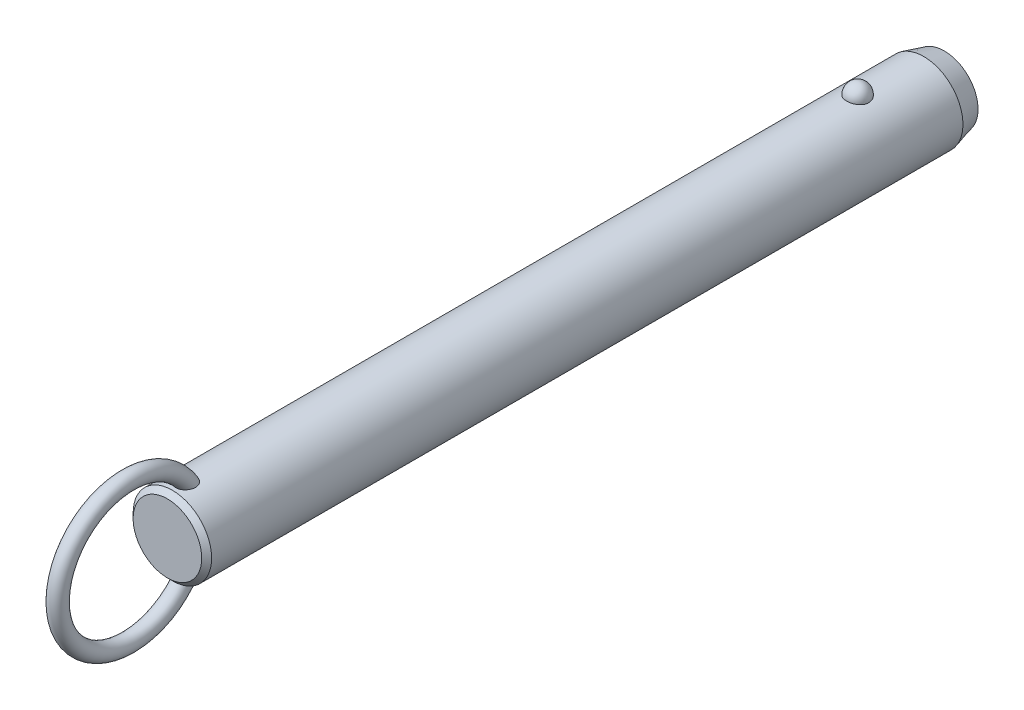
ISO-10303-21;
HEADER;
FILE_DESCRIPTION(('STEP AP214'),'2;1');
FILE_NAME('part.step','',(''),(''),'','','');
FILE_SCHEMA(('AUTOMOTIVE_DESIGN { 1 0 10303 214 1 1 1 1 }'));
ENDSEC;
DATA;
#1=APPLICATION_CONTEXT('core data for automotive mechanical design processes');
#2=APPLICATION_PROTOCOL_DEFINITION('international standard','automotive_design',2000,#1);
#3=PRODUCT_CONTEXT('',#1,'mechanical');
#4=PRODUCT('Part','Part','',(#3));
#5=PRODUCT_RELATED_PRODUCT_CATEGORY('part','',(#4));
#6=PRODUCT_DEFINITION_FORMATION('','',#4);
#7=PRODUCT_DEFINITION_CONTEXT('part definition',#1,'design');
#8=PRODUCT_DEFINITION('design','',#6,#7);
#9=PRODUCT_DEFINITION_SHAPE('','',#8);
#10=(LENGTH_UNIT() NAMED_UNIT(*) SI_UNIT(.MILLI.,.METRE.));
#11=(NAMED_UNIT(*) PLANE_ANGLE_UNIT() SI_UNIT($,.RADIAN.));
#12=(NAMED_UNIT(*) SI_UNIT($,.STERADIAN.) SOLID_ANGLE_UNIT());
#13=UNCERTAINTY_MEASURE_WITH_UNIT(LENGTH_MEASURE(1.E-05),#10,'distance_accuracy_value','');
#14=(GEOMETRIC_REPRESENTATION_CONTEXT(3) GLOBAL_UNCERTAINTY_ASSIGNED_CONTEXT((#13)) GLOBAL_UNIT_ASSIGNED_CONTEXT((#10,
#11,#12)) REPRESENTATION_CONTEXT('',''));
#15=CARTESIAN_POINT('',(0.,0.,0.));
#16=DIRECTION('',(0.,0.,1.));
#17=DIRECTION('',(1.,0.,0.));
#18=AXIS2_PLACEMENT_3D('',#15,#16,#17);
#19=CARTESIAN_POINT('',(0.,0.,154.9));
#20=DIRECTION('',(0.,0.,-1.));
#21=DIRECTION('',(-1.,0.,0.));
#22=AXIS2_PLACEMENT_3D('',#19,#20,#21);
#23=CYLINDRICAL_SURFACE('',#22,9.5);
#24=CARTESIAN_POINT('',(2.67259918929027,9.11631578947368,-2.70000000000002));
#25=CARTESIAN_POINT('',(2.6725968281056,9.11631786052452,-2.54909854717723));
#26=CARTESIAN_POINT('',(2.66030567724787,9.11994722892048,-2.39816735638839));
#27=CARTESIAN_POINT('',(2.6114347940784,9.13405924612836,-2.10058568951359));
#28=CARTESIAN_POINT('',(2.57484658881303,9.14454428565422,-1.95393672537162));
#29=CARTESIAN_POINT('',(2.47830875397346,9.17117631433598,-1.66916069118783));
#30=CARTESIAN_POINT('',(2.41836936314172,9.18732082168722,-1.53102991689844));
#31=CARTESIAN_POINT('',(2.27661331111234,9.22346780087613,-1.26705393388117));
#32=CARTESIAN_POINT('',(2.19479699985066,9.24347021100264,-1.14120852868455));
#33=CARTESIAN_POINT('',(2.01085282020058,9.28522401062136,-0.904632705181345));
#34=CARTESIAN_POINT('',(1.90862396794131,9.30698376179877,-0.793982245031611));
#35=CARTESIAN_POINT('',(1.6867437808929,9.34973971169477,-0.59160721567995));
#36=CARTESIAN_POINT('',(1.56709244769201,9.37073591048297,-0.499882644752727));
#37=CARTESIAN_POINT('',(1.31393976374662,9.40956370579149,-0.338167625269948));
#38=CARTESIAN_POINT('',(1.18048026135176,9.42740444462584,-0.268113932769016));
#39=CARTESIAN_POINT('',(0.903154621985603,9.45799906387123,-0.151390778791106));
#40=CARTESIAN_POINT('',(0.759289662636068,9.47075351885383,-0.104718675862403));
#41=CARTESIAN_POINT('',(0.468074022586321,9.48956256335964,-0.0367633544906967));
#42=CARTESIAN_POINT('',(0.320836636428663,9.49573643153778,-0.0150275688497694));
#43=CARTESIAN_POINT('',(0.0246714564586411,9.50112183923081,0.00396199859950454));
#44=CARTESIAN_POINT('',(-0.124256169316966,9.50033406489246,0.00121819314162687));
#45=CARTESIAN_POINT('',(-0.417264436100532,9.4919475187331,-0.0284441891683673));
#46=CARTESIAN_POINT('',(-0.56138413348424,9.48444885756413,-0.0550074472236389));
#47=CARTESIAN_POINT('',(-0.842986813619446,9.46357853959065,-0.131064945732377));
#48=CARTESIAN_POINT('',(-0.980469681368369,9.450206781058,-0.180559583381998));
#49=CARTESIAN_POINT('',(-1.24585005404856,9.41890822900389,-0.301476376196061));
#50=CARTESIAN_POINT('',(-1.37368611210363,9.40095498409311,-0.373026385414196));
#51=CARTESIAN_POINT('',(-1.61552738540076,9.36242964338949,-0.536025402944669));
#52=CARTESIAN_POINT('',(-1.72953116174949,9.34185727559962,-0.627476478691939));
#53=CARTESIAN_POINT('',(-1.9429225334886,9.29984568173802,-0.829844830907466));
#54=CARTESIAN_POINT('',(-2.04198021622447,9.27839736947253,-0.941108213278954));
#55=CARTESIAN_POINT('',(-2.22026460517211,9.23735994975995,-1.17883414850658));
#56=CARTESIAN_POINT('',(-2.29948985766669,9.21777097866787,-1.30529781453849));
#57=CARTESIAN_POINT('',(-2.43697287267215,9.18238994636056,-1.57158566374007));
#58=CARTESIAN_POINT('',(-2.49497068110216,9.16664569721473,-1.71155057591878));
#59=CARTESIAN_POINT('',(-2.5872073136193,9.14104303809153,-1.99961197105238));
#60=CARTESIAN_POINT('',(-2.62144683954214,9.13118445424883,-2.1477082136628));
#61=CARTESIAN_POINT('',(-2.66521466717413,9.11850622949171,-2.44715424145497));
#62=CARTESIAN_POINT('',(-2.67484831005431,9.11565658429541,-2.59848735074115));
#63=CARTESIAN_POINT('',(-2.66946735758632,9.11723375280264,-2.90067317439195));
#64=CARTESIAN_POINT('',(-2.65445345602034,9.12166036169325,-3.05152590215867));
#65=CARTESIAN_POINT('',(-2.60029711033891,9.13724422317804,-3.34766110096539));
#66=CARTESIAN_POINT('',(-2.56127978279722,9.14836656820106,-3.49296833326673));
#67=CARTESIAN_POINT('',(-2.46018844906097,9.17606676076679,-3.77477535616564));
#68=CARTESIAN_POINT('',(-2.39811349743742,9.1926448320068,-3.91127478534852));
#69=CARTESIAN_POINT('',(-2.25202303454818,9.22952198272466,-4.17244273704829));
#70=CARTESIAN_POINT('',(-2.16788714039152,9.24984129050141,-4.29704106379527));
#71=CARTESIAN_POINT('',(-1.9799408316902,9.29188255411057,-4.53013066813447));
#72=CARTESIAN_POINT('',(-1.87612963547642,9.31360456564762,-4.63862130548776));
#73=CARTESIAN_POINT('',(-1.65105429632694,9.35612959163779,-4.83690299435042));
#74=CARTESIAN_POINT('',(-1.52972405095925,9.37692871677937,-4.9266199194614));
#75=CARTESIAN_POINT('',(-1.27318250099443,9.41518970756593,-5.08429106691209));
#76=CARTESIAN_POINT('',(-1.13797219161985,9.432651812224,-5.15224684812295));
#77=CARTESIAN_POINT('',(-0.859280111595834,9.46208255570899,-5.26371827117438));
#78=CARTESIAN_POINT('',(-0.715925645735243,9.47411833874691,-5.30753421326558));
#79=CARTESIAN_POINT('',(-0.423550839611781,9.4916822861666,-5.37076321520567));
#80=CARTESIAN_POINT('',(-0.2745312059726,9.49721125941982,-5.39017930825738));
#81=CARTESIAN_POINT('',(0.0218446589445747,9.50110860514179,-5.40390587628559));
#82=CARTESIAN_POINT('',(0.16917707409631,9.49961381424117,-5.39869609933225));
#83=CARTESIAN_POINT('',(0.460808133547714,9.48993906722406,-5.36441955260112));
#84=CARTESIAN_POINT('',(0.605106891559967,9.48175936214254,-5.33535367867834));
#85=CARTESIAN_POINT('',(0.886027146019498,9.4596376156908,-5.25435587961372));
#86=CARTESIAN_POINT('',(1.02267710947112,9.44571881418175,-5.20251612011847));
#87=CARTESIAN_POINT('',(1.28523827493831,9.41358993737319,-5.07741549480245));
#88=CARTESIAN_POINT('',(1.41114877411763,9.39537958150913,-5.00415322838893));
#89=CARTESIAN_POINT('',(1.65085227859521,9.3562644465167,-4.83684599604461));
#90=CARTESIAN_POINT('',(1.76442346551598,9.33532178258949,-4.74249218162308));
#91=CARTESIAN_POINT('',(1.97425672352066,9.29321198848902,-4.53620389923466));
#92=CARTESIAN_POINT('',(2.07051582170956,9.27204482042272,-4.42426641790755));
#93=CARTESIAN_POINT('',(2.24490086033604,9.23139221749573,-4.18363183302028));
#94=CARTESIAN_POINT('',(2.32267019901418,9.21194380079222,-4.05466990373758));
#95=CARTESIAN_POINT('',(2.45584092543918,9.1773419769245,-3.78517836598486));
#96=CARTESIAN_POINT('',(2.5112497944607,9.16218713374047,-3.644652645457));
#97=CARTESIAN_POINT('',(2.59380876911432,9.13913522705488,-3.37104301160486));
#98=CARTESIAN_POINT('',(2.62330266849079,9.13064624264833,-3.23871053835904));
#99=CARTESIAN_POINT('',(2.66269870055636,9.11923566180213,-2.97092664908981));
#100=CARTESIAN_POINT('',(2.67260130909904,9.11631393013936,-2.83547530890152));
#101=CARTESIAN_POINT('',(2.67259918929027,9.11631578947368,-2.70000000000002));
#102=B_SPLINE_CURVE_WITH_KNOTS('',3,(#24,#25,#26,#27,#28,#29,#30,#31,#32,#33,#34,#35,#36,#37,
#38,#39,#40,#41,#42,#43,#44,#45,#46,#47,#48,#49,#50,#51,#52,#53,#54,#55,#56,#57,#58,#59,#60,#61,
#62,#63,#64,#65,#66,#67,#68,#69,#70,#71,#72,#73,#74,#75,#76,#77,#78,#79,#80,#81,#82,#83,#84,#85,
#86,#87,#88,#89,#90,#91,#92,#93,#94,#95,#96,#97,#98,#99,#100,#101),.UNSPECIFIED.,.T.,.F.,(4,2,2,
2,2,2,2,2,2,2,2,2,2,2,2,2,2,2,2,2,2,2,2,2,2,2,2,2,2,2,2,2,2,2,2,2,2,2,4),(0.,0.452217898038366,
0.904593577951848,1.35677112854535,1.80894144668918,2.26340676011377,2.71787203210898,
3.17099820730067,3.62407318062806,4.0687883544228,4.51345969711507,4.95160616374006,
5.38976021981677,5.83050358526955,6.27129275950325,6.72071308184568,7.17016633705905,
7.62495278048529,8.07972578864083,8.53254856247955,8.98535859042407,9.43582813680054,
9.88631615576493,10.3393155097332,10.7923328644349,11.2471065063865,11.7018475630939,
12.150795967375,12.599688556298,13.0398725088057,13.4800399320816,13.9184421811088,
14.3568730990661,14.802202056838,15.2476074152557,15.7010097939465,16.1542603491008,
16.5602594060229,16.966248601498),.UNSPECIFIED.);
#103=CARTESIAN_POINT('',(2.67259918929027,9.11631578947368,-2.70000000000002));
#104=VERTEX_POINT('',#103);
#105=EDGE_CURVE('E41',#104,#104,#102,.T.);
#106=ORIENTED_EDGE('',*,*,#105,.T.);
#107=EDGE_LOOP('',(#106));
#108=FACE_BOUND('',#107,.T.);
#109=CARTESIAN_POINT('',(0.,0.,163.22));
#110=DIRECTION('',(0.,0.,1.));
#111=DIRECTION('',(1.,0.,0.));
#112=AXIS2_PLACEMENT_3D('',#109,#110,#111);
#113=CIRCLE('',#112,9.5);
#114=CARTESIAN_POINT('',(9.5,0.,163.22));
#115=VERTEX_POINT('',#114);
#116=EDGE_CURVE('E10',#115,#115,#113,.F.);
#117=ORIENTED_EDGE('',*,*,#116,.T.);
#118=EDGE_LOOP('',(#117));
#119=FACE_BOUND('',#118,.T.);
#120=CARTESIAN_POINT('',(-0.697062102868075,-9.47439269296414,157.567808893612));
#121=CARTESIAN_POINT('',(-0.799579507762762,-9.46685146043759,157.607482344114));
#122=CARTESIAN_POINT('',(-0.89857563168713,-9.45788043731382,157.6559309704));
#123=CARTESIAN_POINT('',(-1.08670047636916,-9.43811593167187,157.768868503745));
#124=CARTESIAN_POINT('',(-1.17583204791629,-9.42732297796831,157.833352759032));
#125=CARTESIAN_POINT('',(-1.34179806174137,-9.40513672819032,157.976209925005));
#126=CARTESIAN_POINT('',(-1.41865133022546,-9.39374438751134,158.054561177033));
#127=CARTESIAN_POINT('',(-1.5586004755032,-9.37154196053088,158.222752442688));
#128=CARTESIAN_POINT('',(-1.62169476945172,-9.3607319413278,158.31259377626));
#129=CARTESIAN_POINT('',(-1.73527695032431,-9.34035749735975,158.504500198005));
#130=CARTESIAN_POINT('',(-1.78522266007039,-9.33085270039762,158.606891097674));
#131=CARTESIAN_POINT('',(-1.86924997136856,-9.3143834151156,158.818148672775));
#132=CARTESIAN_POINT('',(-1.90332570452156,-9.30741986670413,158.927017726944));
#133=CARTESIAN_POINT('',(-1.95893603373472,-9.29588482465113,159.160473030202));
#134=CARTESIAN_POINT('',(-1.97872420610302,-9.29165182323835,159.285489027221));
#135=CARTESIAN_POINT('',(-2.00062129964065,-9.28695978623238,159.537080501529));
#136=CARTESIAN_POINT('',(-2.00272284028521,-9.28650232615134,159.663656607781));
#137=CARTESIAN_POINT('',(-1.98958876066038,-9.28932750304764,159.936815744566));
#138=CARTESIAN_POINT('',(-1.97143366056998,-9.2932400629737,160.083251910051));
#139=CARTESIAN_POINT('',(-1.91479925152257,-9.30507151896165,160.372062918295));
#140=CARTESIAN_POINT('',(-1.87629122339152,-9.31299607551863,160.514431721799));
#141=CARTESIAN_POINT('',(-1.7722568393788,-9.33340232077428,160.815172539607));
#142=CARTESIAN_POINT('',(-1.70334898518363,-9.34641636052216,160.972369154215));
#143=CARTESIAN_POINT('',(-1.58111062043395,-9.36759153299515,161.197517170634));
#144=CARTESIAN_POINT('',(-1.53721459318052,-9.3749261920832,161.270796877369));
#145=CARTESIAN_POINT('',(-1.44302631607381,-9.38988566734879,161.41307405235));
#146=CARTESIAN_POINT('',(-1.39273721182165,-9.39751033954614,161.482073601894));
#147=CARTESIAN_POINT('',(-1.26775962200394,-9.41530678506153,161.636983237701));
#148=CARTESIAN_POINT('',(-1.19052326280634,-9.42548108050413,161.720871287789));
#149=CARTESIAN_POINT('',(-1.0242024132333,-9.44499825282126,161.876008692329));
#150=CARTESIAN_POINT('',(-0.935139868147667,-9.45434261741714,161.947280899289));
#151=CARTESIAN_POINT('',(-0.766610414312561,-9.46930670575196,162.058695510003));
#152=CARTESIAN_POINT('',(-0.689439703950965,-9.47529223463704,162.102235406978));
#153=CARTESIAN_POINT('',(-0.52894200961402,-9.48560294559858,162.17631336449));
#154=CARTESIAN_POINT('',(-0.445620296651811,-9.48992953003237,162.206862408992));
#155=CARTESIAN_POINT('',(-0.273901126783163,-9.49644161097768,162.252579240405));
#156=CARTESIAN_POINT('',(-0.18546574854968,-9.49860811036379,162.26761059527));
#157=CARTESIAN_POINT('',(-0.00734541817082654,-9.5004135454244,162.280149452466));
#158=CARTESIAN_POINT('',(0.082338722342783,-9.50005405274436,162.277667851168));
#159=CARTESIAN_POINT('',(0.247679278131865,-9.49708301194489,162.256995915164));
#160=CARTESIAN_POINT('',(0.323620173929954,-9.49477609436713,162.240930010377));
#161=CARTESIAN_POINT('',(0.471981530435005,-9.48855917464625,162.197172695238));
#162=CARTESIAN_POINT('',(0.544400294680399,-9.48464840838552,162.169475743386));
#163=CARTESIAN_POINT('',(0.708947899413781,-9.47398336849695,162.09280266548));
#164=CARTESIAN_POINT('',(0.799149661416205,-9.46671310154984,162.039774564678));
#165=CARTESIAN_POINT('',(0.969783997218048,-9.45076225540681,161.919973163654));
#166=CARTESIAN_POINT('',(1.05019415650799,-9.44207854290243,161.853169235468));
#167=CARTESIAN_POINT('',(1.23092343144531,-9.42051459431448,161.680759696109));
#168=CARTESIAN_POINT('',(1.32652499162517,-9.40733378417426,161.57026193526));
#169=CARTESIAN_POINT('',(1.49893121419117,-9.38140745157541,161.335561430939));
#170=CARTESIAN_POINT('',(1.57571616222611,-9.36866239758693,161.211344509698));
#171=CARTESIAN_POINT('',(1.71285426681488,-9.34457644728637,160.949389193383));
#172=CARTESIAN_POINT('',(1.77266365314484,-9.33328726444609,160.81136233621));
#173=CARTESIAN_POINT('',(1.87239208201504,-9.31379209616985,160.528051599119));
#174=CARTESIAN_POINT('',(1.91230158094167,-9.30558759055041,160.382764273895));
#175=CARTESIAN_POINT('',(1.97604189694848,-9.29228394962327,160.062028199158));
#176=CARTESIAN_POINT('',(1.9958743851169,-9.28797202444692,159.885724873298));
#177=CARTESIAN_POINT('',(2.00295708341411,-9.28645519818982,159.532414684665));
#178=CARTESIAN_POINT('',(1.99025930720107,-9.28923895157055,159.355409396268));
#179=CARTESIAN_POINT('',(1.93735479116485,-9.30038134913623,159.056338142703));
#180=CARTESIAN_POINT('',(1.90576827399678,-9.30697680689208,158.932667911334));
#181=CARTESIAN_POINT('',(1.82287484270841,-9.32356855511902,158.692329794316));
#182=CARTESIAN_POINT('',(1.77158213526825,-9.33356239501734,158.575656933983));
#183=CARTESIAN_POINT('',(1.64885744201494,-9.35602275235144,158.352706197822));
#184=CARTESIAN_POINT('',(1.57730995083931,-9.36850332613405,158.246492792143));
#185=CARTESIAN_POINT('',(1.41543264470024,-9.39431873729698,158.049553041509));
#186=CARTESIAN_POINT('',(1.32510883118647,-9.40765330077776,157.958821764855));
#187=CARTESIAN_POINT('',(1.13846223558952,-9.43195720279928,157.805033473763));
#188=CARTESIAN_POINT('',(1.04369890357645,-9.44302894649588,157.740094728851));
#189=CARTESIAN_POINT('',(0.843965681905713,-9.46296805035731,157.628038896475));
#190=CARTESIAN_POINT('',(0.739000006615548,-9.47183631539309,157.580914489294));
#191=CARTESIAN_POINT('',(0.528175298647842,-9.48586140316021,157.508117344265));
#192=CARTESIAN_POINT('',(0.422686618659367,-9.49119633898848,157.48140249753));
#193=CARTESIAN_POINT('',(0.208590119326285,-9.49831365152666,157.446013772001));
#194=CARTESIAN_POINT('',(0.0999817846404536,-9.500095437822,157.437342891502));
#195=CARTESIAN_POINT('',(-0.126104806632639,-9.49988861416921,157.438350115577));
#196=CARTESIAN_POINT('',(-0.243578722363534,-9.49757821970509,157.449594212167));
#197=CARTESIAN_POINT('',(-0.474390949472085,-9.48885165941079,157.493167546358));
#198=CARTESIAN_POINT('',(-0.587729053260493,-9.48243528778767,157.525497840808));
#199=CARTESIAN_POINT('',(-0.697062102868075,-9.47439269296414,157.567808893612));
#200=B_SPLINE_CURVE_WITH_KNOTS('',3,(#120,#121,#122,#123,#124,#125,#126,#127,#128,#129,#130,
#131,#132,#133,#134,#135,#136,#137,#138,#139,#140,#141,#142,#143,#144,#145,#146,#147,#148,#149,
#150,#151,#152,#153,#154,#155,#156,#157,#158,#159,#160,#161,#162,#163,#164,#165,#166,#167,#168,
#169,#170,#171,#172,#173,#174,#175,#176,#177,#178,#179,#180,#181,#182,#183,#184,#185,#186,#187,
#188,#189,#190,#191,#192,#193,#194,#195,#196,#197,#198,#199),.UNSPECIFIED.,.T.,.F.,(4,2,2,2,2,2,
2,2,2,2,2,2,2,2,2,2,2,2,2,2,2,2,2,2,2,2,2,2,2,2,2,2,2,2,2,2,2,2,2,4),(0.,0.330119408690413,
0.6601431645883,0.98965593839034,1.31920659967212,1.66074728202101,2.00241415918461,
2.38088696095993,2.75951768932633,3.20065679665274,3.64242004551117,4.15620996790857,
4.4131416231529,4.66994734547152,5.01228664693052,5.35399933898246,5.61943037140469,
5.88463652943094,6.15215502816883,6.41950709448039,6.65144391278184,6.88349136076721,
7.19641200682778,7.51003602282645,7.94779711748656,8.3860149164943,8.83699707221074,
9.28819530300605,9.81778662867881,10.34653170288,10.7284172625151,11.1100280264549,
11.4938603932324,11.8775702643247,12.2220189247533,12.5663259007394,12.8915939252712,
13.2169159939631,13.5689650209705,13.9210316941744),.UNSPECIFIED.);
#201=CARTESIAN_POINT('',(-0.697062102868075,-9.47439269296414,157.567808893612));
#202=VERTEX_POINT('',#201);
#203=EDGE_CURVE('E59',#202,#202,#200,.T.);
#204=ORIENTED_EDGE('',*,*,#203,.T.);
#205=EDGE_LOOP('',(#204));
#206=FACE_BOUND('',#205,.T.);
#207=CARTESIAN_POINT('',(-0.697062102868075,9.47439269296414,157.567808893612));
#208=CARTESIAN_POINT('',(-0.597792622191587,9.48169483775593,157.52939564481));
#209=CARTESIAN_POINT('',(-0.495106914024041,9.48766580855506,157.499168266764));
#210=CARTESIAN_POINT('',(-0.285876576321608,9.49627648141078,157.456032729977));
#211=CARTESIAN_POINT('',(-0.179324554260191,9.49890941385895,157.443159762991));
#212=CARTESIAN_POINT('',(0.0344157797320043,9.50053798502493,157.435166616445));
#213=CARTESIAN_POINT('',(0.14160360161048,9.49953613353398,157.440034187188));
#214=CARTESIAN_POINT('',(0.353563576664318,9.49401038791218,157.467365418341));
#215=CARTESIAN_POINT('',(0.458336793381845,9.48948807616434,157.48982117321));
#216=CARTESIAN_POINT('',(0.662493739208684,9.4774236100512,157.551671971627));
#217=CARTESIAN_POINT('',(0.761881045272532,9.46988348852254,157.591055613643));
#218=CARTESIAN_POINT('',(0.952608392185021,9.45260382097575,157.685634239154));
#219=CARTESIAN_POINT('',(1.04394806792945,9.44286417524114,157.740829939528));
#220=CARTESIAN_POINT('',(1.21712767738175,9.42211760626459,157.866066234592));
#221=CARTESIAN_POINT('',(1.29885671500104,9.41109835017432,157.936257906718));
#222=CARTESIAN_POINT('',(1.44978975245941,9.38903310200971,158.088980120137));
#223=CARTESIAN_POINT('',(1.51899278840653,9.37798710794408,158.171511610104));
#224=CARTESIAN_POINT('',(1.64602857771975,9.35654375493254,158.349776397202));
#225=CARTESIAN_POINT('',(1.70333052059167,9.34618688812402,158.445891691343));
#226=CARTESIAN_POINT('',(1.80259341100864,9.32755128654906,158.645897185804));
#227=CARTESIAN_POINT('',(1.84454942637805,9.31927322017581,158.749789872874));
#228=CARTESIAN_POINT('',(1.91637039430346,9.30478365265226,158.972213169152));
#229=CARTESIAN_POINT('',(1.944805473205,9.29882552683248,159.091219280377));
#230=CARTESIAN_POINT('',(1.98449865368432,9.29043398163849,159.332143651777));
#231=CARTESIAN_POINT('',(1.99574908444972,9.28800213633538,159.454063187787));
#232=CARTESIAN_POINT('',(2.00275141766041,9.28649645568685,159.716932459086));
#233=CARTESIAN_POINT('',(1.99588238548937,9.28799035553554,159.857952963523));
#234=CARTESIAN_POINT('',(1.96270559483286,9.29505517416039,160.137621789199));
#235=CARTESIAN_POINT('',(1.93637872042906,9.30063010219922,160.276267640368));
#236=CARTESIAN_POINT('',(1.85949176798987,9.31633564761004,160.572561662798));
#237=CARTESIAN_POINT('',(1.80549792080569,9.3270926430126,160.729290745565));
#238=CARTESIAN_POINT('',(1.67376869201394,9.3516306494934,161.032284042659));
#239=CARTESIAN_POINT('',(1.59603181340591,9.36541185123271,161.178547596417));
#240=CARTESIAN_POINT('',(1.4360277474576,9.39110706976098,161.425813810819));
#241=CARTESIAN_POINT('',(1.35831795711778,9.40278656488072,161.529791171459));
#242=CARTESIAN_POINT('',(1.18774483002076,9.42585025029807,161.724534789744));
#243=CARTESIAN_POINT('',(1.09490932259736,9.43723493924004,161.815324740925));
#244=CARTESIAN_POINT('',(0.921110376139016,9.45552616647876,161.95620334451));
#245=CARTESIAN_POINT('',(0.843738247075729,9.46281058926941,162.010656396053));
#246=CARTESIAN_POINT('',(0.681245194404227,9.47589120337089,162.106711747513));
#247=CARTESIAN_POINT('',(0.596135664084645,9.48168953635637,162.148332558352));
#248=CARTESIAN_POINT('',(0.433779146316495,9.49038144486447,162.210089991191));
#249=CARTESIAN_POINT('',(0.35745955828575,9.49359170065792,162.23260136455));
#250=CARTESIAN_POINT('',(0.202074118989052,9.49816761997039,162.264574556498));
#251=CARTESIAN_POINT('',(0.123010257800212,9.49953459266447,162.274045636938));
#252=CARTESIAN_POINT('',(-0.0357372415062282,9.50026497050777,162.279114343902));
#253=CARTESIAN_POINT('',(-0.115421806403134,9.49962433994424,162.274684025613));
#254=CARTESIAN_POINT('',(-0.272823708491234,9.49640854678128,162.252296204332));
#255=CARTESIAN_POINT('',(-0.350540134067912,9.4938325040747,162.234332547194));
#256=CARTESIAN_POINT('',(-0.500580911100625,9.48709462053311,162.186802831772));
#257=CARTESIAN_POINT('',(-0.572979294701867,9.48296359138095,162.157461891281));
#258=CARTESIAN_POINT('',(-0.71286452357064,9.47347609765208,162.089008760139));
#259=CARTESIAN_POINT('',(-0.780349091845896,9.46811906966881,162.049892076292));
#260=CARTESIAN_POINT('',(-0.946309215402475,9.45329720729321,161.939432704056));
#261=CARTESIAN_POINT('',(-1.04090230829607,9.44321512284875,161.862329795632));
#262=CARTESIAN_POINT('',(-1.21661929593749,9.42219227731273,161.69409718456));
#263=CARTESIAN_POINT('',(-1.29770519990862,9.41124921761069,161.602929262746));
#264=CARTESIAN_POINT('',(-1.47319646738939,9.38563439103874,161.376162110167));
#265=CARTESIAN_POINT('',(-1.5620887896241,9.37102009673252,161.236289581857));
#266=CARTESIAN_POINT('',(-1.71623987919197,9.34401559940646,160.943950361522));
#267=CARTESIAN_POINT('',(-1.7814786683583,9.33162728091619,160.791473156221));
#268=CARTESIAN_POINT('',(-1.88853837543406,9.31055541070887,160.475647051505));
#269=CARTESIAN_POINT('',(-1.92998995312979,9.30193076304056,160.312168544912));
#270=CARTESIAN_POINT('',(-1.98590726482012,9.29015757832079,159.980526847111));
#271=CARTESIAN_POINT('',(-2.0004070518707,9.2870021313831,159.812369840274));
#272=CARTESIAN_POINT('',(-1.99964701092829,9.28716218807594,159.505080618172));
#273=CARTESIAN_POINT('',(-1.98908145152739,9.28945704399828,159.365936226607));
#274=CARTESIAN_POINT('',(-1.94566294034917,9.29865169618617,159.091153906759));
#275=CARTESIAN_POINT('',(-1.91282062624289,9.30554929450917,158.955514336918));
#276=CARTESIAN_POINT('',(-1.84582133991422,9.31898248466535,158.757802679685));
#277=CARTESIAN_POINT('',(-1.82038084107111,9.32400364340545,158.692583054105));
#278=CARTESIAN_POINT('',(-1.7635051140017,9.33492884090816,158.564903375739));
#279=CARTESIAN_POINT('',(-1.73207305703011,9.34083241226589,158.502441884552));
#280=CARTESIAN_POINT('',(-1.66324243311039,9.35333332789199,158.38094078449));
#281=CARTESIAN_POINT('',(-1.625842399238,9.35993084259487,158.321902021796));
#282=CARTESIAN_POINT('',(-1.54527678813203,9.37356864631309,158.207987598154));
#283=CARTESIAN_POINT('',(-1.50211241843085,9.38060884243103,158.153111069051));
#284=CARTESIAN_POINT('',(-1.37681147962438,9.40004442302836,158.009961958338));
#285=CARTESIAN_POINT('',(-1.28916358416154,9.41261047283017,157.926429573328));
#286=CARTESIAN_POINT('',(-1.09996826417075,9.43658180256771,157.777236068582));
#287=CARTESIAN_POINT('',(-0.998461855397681,9.44799034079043,157.711523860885));
#288=CARTESIAN_POINT('',(-0.860188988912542,9.46103017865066,157.6394367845));
#289=CARTESIAN_POINT('',(-0.828141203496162,9.46389141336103,157.623851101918));
#290=CARTESIAN_POINT('',(-0.763210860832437,9.46934915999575,157.594473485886));
#291=CARTESIAN_POINT('',(-0.730328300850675,9.47194567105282,157.580681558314));
#292=CARTESIAN_POINT('',(-0.697062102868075,9.47439269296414,157.567808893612));
#293=B_SPLINE_CURVE_WITH_KNOTS('',3,(#207,#208,#209,#210,#211,#212,#213,#214,#215,#216,#217,
#218,#219,#220,#221,#222,#223,#224,#225,#226,#227,#228,#229,#230,#231,#232,#233,#234,#235,#236,
#237,#238,#239,#240,#241,#242,#243,#244,#245,#246,#247,#248,#249,#250,#251,#252,#253,#254,#255,
#256,#257,#258,#259,#260,#261,#262,#263,#264,#265,#266,#267,#268,#269,#270,#271,#272,#273,#274,
#275,#276,#277,#278,#279,#280,#281,#282,#283,#284,#285,#286,#287,#288,#289,#290,#291,#292),
.UNSPECIFIED.,.T.,.F.,(4,2,2,2,2,2,2,2,2,2,2,2,2,2,2,2,2,2,2,2,2,2,2,2,2,2,2,2,2,2,2,2,2,2,2,2,
2,2,2,2,2,2,4),(0.,0.319942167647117,0.640532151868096,0.960900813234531,1.28112555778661,
1.60113495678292,1.92115886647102,2.24457323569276,2.56801248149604,2.90371927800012,
3.23953387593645,3.60560313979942,3.97183576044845,4.39383693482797,4.81625324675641,
5.31257045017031,5.80891895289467,6.19868344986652,6.58773876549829,6.87145417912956,
7.15475838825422,7.3926375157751,7.63034760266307,7.86853584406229,8.10683246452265,
8.3406366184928,8.57454843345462,8.93983939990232,9.30614105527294,9.80266668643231,
10.2996107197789,10.8040753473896,11.3079021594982,11.7249776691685,12.1418541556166,
12.3521485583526,12.5623319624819,12.7725671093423,12.9827582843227,13.345827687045,
13.7078449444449,13.8150604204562,13.9222762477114),.UNSPECIFIED.);
#294=CARTESIAN_POINT('',(-0.697062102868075,9.47439269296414,157.567808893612));
#295=VERTEX_POINT('',#294);
#296=EDGE_CURVE('E67',#295,#295,#293,.T.);
#297=ORIENTED_EDGE('',*,*,#296,.T.);
#298=EDGE_LOOP('',(#297));
#299=FACE_BOUND('',#298,.T.);
#300=CARTESIAN_POINT('',(0.,0.,-18.6999999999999));
#301=DIRECTION('',(0.,0.,-1.));
#302=DIRECTION('',(-1.,0.,0.));
#303=AXIS2_PLACEMENT_3D('',#300,#301,#302);
#304=CIRCLE('',#303,9.5);
#305=CARTESIAN_POINT('',(-9.5,0.,-18.6999999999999));
#306=VERTEX_POINT('',#305);
#307=EDGE_CURVE('E56',#306,#306,#304,.F.);
#308=ORIENTED_EDGE('',*,*,#307,.T.);
#309=EDGE_LOOP('',(#308));
#310=FACE_BOUND('',#309,.T.);
#311=ADVANCED_FACE('F37',(#108,#119,#206,#299,#310),#23,.T.);
#312=CARTESIAN_POINT('',(0.,0.,-23.7));
#313=DIRECTION('',(0.,0.,-1.));
#314=DIRECTION('',(-1.,0.,0.));
#315=AXIS2_PLACEMENT_3D('',#312,#313,#314);
#316=PLANE('',#315);
#317=CARTESIAN_POINT('',(0.,0.,-23.7));
#318=DIRECTION('',(0.,0.,-1.));
#319=DIRECTION('',(-1.,0.,0.));
#320=AXIS2_PLACEMENT_3D('',#317,#318,#319);
#321=CIRCLE('',#320,8.16025403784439);
#322=CARTESIAN_POINT('',(-8.16025403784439,0.,-23.7));
#323=VERTEX_POINT('',#322);
#324=EDGE_CURVE('E66',#323,#323,#321,.T.);
#325=ORIENTED_EDGE('',*,*,#324,.T.);
#326=EDGE_LOOP('',(#325));
#327=FACE_BOUND('',#326,.T.);
#328=ADVANCED_FACE('F85',(#327),#316,.T.);
#329=CARTESIAN_POINT('',(0.,0.,-23.7));
#330=DIRECTION('',(0.,0.,1.));
#331=DIRECTION('',(1.,0.,0.));
#332=AXIS2_PLACEMENT_3D('',#329,#330,#331);
#333=CONICAL_SURFACE('',#332,8.16025403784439,0.261799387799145);
#334=ORIENTED_EDGE('',*,*,#307,.F.);
#335=EDGE_LOOP('',(#334));
#336=FACE_BOUND('',#335,.T.);
#337=ORIENTED_EDGE('',*,*,#324,.F.);
#338=EDGE_LOOP('',(#337));
#339=FACE_BOUND('',#338,.T.);
#340=ADVANCED_FACE('F83',(#336,#339),#333,.T.);
#341=CARTESIAN_POINT('',(0.,0.,164.42));
#342=DIRECTION('',(0.,0.,1.));
#343=DIRECTION('',(1.,0.,0.));
#344=AXIS2_PLACEMENT_3D('',#341,#342,#343);
#345=PLANE('',#344);
#346=CARTESIAN_POINT('',(0.,0.,164.42));
#347=DIRECTION('',(0.,0.,1.));
#348=DIRECTION('',(1.,0.,0.));
#349=AXIS2_PLACEMENT_3D('',#346,#347,#348);
#350=CIRCLE('',#349,8.30000000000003);
#351=CARTESIAN_POINT('',(8.30000000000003,0.,164.42));
#352=VERTEX_POINT('',#351);
#353=EDGE_CURVE('E50',#352,#352,#350,.T.);
#354=ORIENTED_EDGE('',*,*,#353,.T.);
#355=EDGE_LOOP('',(#354));
#356=FACE_BOUND('',#355,.T.);
#357=ADVANCED_FACE('F77',(#356),#345,.T.);
#358=CARTESIAN_POINT('',(0.,0.,173.95));
#359=DIRECTION('',(1.,0.,0.));
#360=DIRECTION('',(0.,0.,-1.));
#361=AXIS2_PLACEMENT_3D('',#358,#359,#360);
#362=TOROIDAL_SURFACE('',#361,17.05,2.);
#363=ORIENTED_EDGE('',*,*,#296,.F.);
#364=EDGE_LOOP('',(#363));
#365=FACE_BOUND('',#364,.T.);
#366=ORIENTED_EDGE('',*,*,#203,.F.);
#367=EDGE_LOOP('',(#366));
#368=FACE_BOUND('',#367,.T.);
#369=ADVANCED_FACE('F73',(#365,#368),#362,.T.);
#370=CARTESIAN_POINT('',(0.,0.,164.42));
#371=DIRECTION('',(0.,0.,-1.));
#372=DIRECTION('',(-1.,0.,0.));
#373=AXIS2_PLACEMENT_3D('',#370,#371,#372);
#374=CONICAL_SURFACE('',#373,8.30000000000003,0.785398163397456);
#375=ORIENTED_EDGE('',*,*,#116,.F.);
#376=EDGE_LOOP('',(#375));
#377=FACE_BOUND('',#376,.T.);
#378=ORIENTED_EDGE('',*,*,#353,.F.);
#379=EDGE_LOOP('',(#378));
#380=FACE_BOUND('',#379,.T.);
#381=ADVANCED_FACE('F39',(#377,#380),#374,.T.);
#382=CARTESIAN_POINT('',(0.,9.5,-2.70000000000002));
#383=DIRECTION('',(0.,1.,0.));
#384=DIRECTION('',(0.,0.,-1.));
#385=AXIS2_PLACEMENT_3D('',#382,#383,#384);
#386=SPHERICAL_SURFACE('',#385,2.7);
#387=ORIENTED_EDGE('',*,*,#105,.F.);
#388=EDGE_LOOP('',(#387));
#389=FACE_BOUND('',#388,.T.);
#390=ADVANCED_FACE('F79',(#389),#386,.T.);
#391=CLOSED_SHELL('',(#311,#328,#340,#357,#369,#381,#390));
#392=MANIFOLD_SOLID_BREP('B2',#391);
#393=ADVANCED_BREP_SHAPE_REPRESENTATION('',(#18,#392),#14);
#394=SHAPE_DEFINITION_REPRESENTATION(#9,#393);
ENDSEC;
END-ISO-10303-21;
